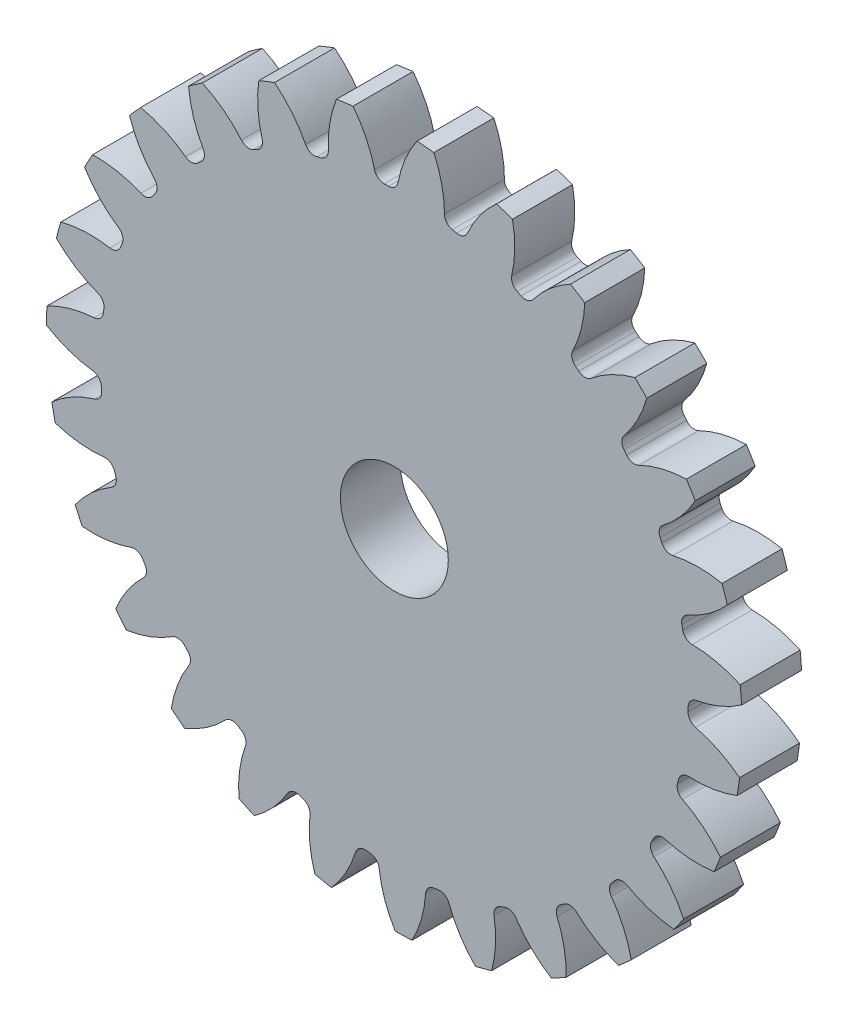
from build123d import *

# Parameters (mm, degrees)
SKETCH3_R         = 736.6
GEARBODY_DEPTH    = 127
TOOTHCUT_DEPTH    = 1050.422755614
CIRPATTERN1_COUNT = 27
BOREDIA_R         = 114.3
BORE_DEPTH        = 12700


with BuildPart() as part:
    # Sketch3 → gearBody (new body)
    with BuildSketch(Plane.XY):
        Circle(SKETCH3_R)
    extrude(amount=GEARBODY_DEPTH)

    # Sketch2 → toothCut (cut, through all)
    with BuildSketch(Plane.XY):
        with BuildLine():
            ThreePointArc((621.830063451, -24.179788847), (621.992063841, -19.574537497), (622.119958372, -14.968212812))
            ThreePointArc((622.119958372, -14.968212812), (627.082486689, -2.020533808), (639.109637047, 4.879954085))
            ThreePointArc((639.109637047, 4.879954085), (690.0699317, 19.937685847), (736.6, 45.601661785))
            ThreePointArc((736.6, 45.601661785), (737.645017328, -23.214219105), (732.274982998, -91.828213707))
            ThreePointArc((732.274982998, -91.828213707), (687.450720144, -63.289251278), (637.538085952, -45.056975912))
            ThreePointArc((637.538085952, -45.056975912), (625.968632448, -37.413885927), (621.830063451, -24.179788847))
        make_face()
    toothcut = extrude(amount=TOOTHCUT_DEPTH, mode=Mode.SUBTRACT)

    # CirPattern1: toothCut ×27 about axis
    cirpattern1_axis = Axis((0, 0, 0), (0, 0, 1))
    for i in range(1, CIRPATTERN1_COUNT):
        add(toothcut.rotate(cirpattern1_axis, i * 360 / CIRPATTERN1_COUNT), mode=Mode.SUBTRACT)

    # boreDia → bore (cut, symmetric)
    with BuildSketch(Plane.XY):
        Circle(BOREDIA_R)
    extrude(amount=BORE_DEPTH, both=True, mode=Mode.SUBTRACT)


solid = part.part
